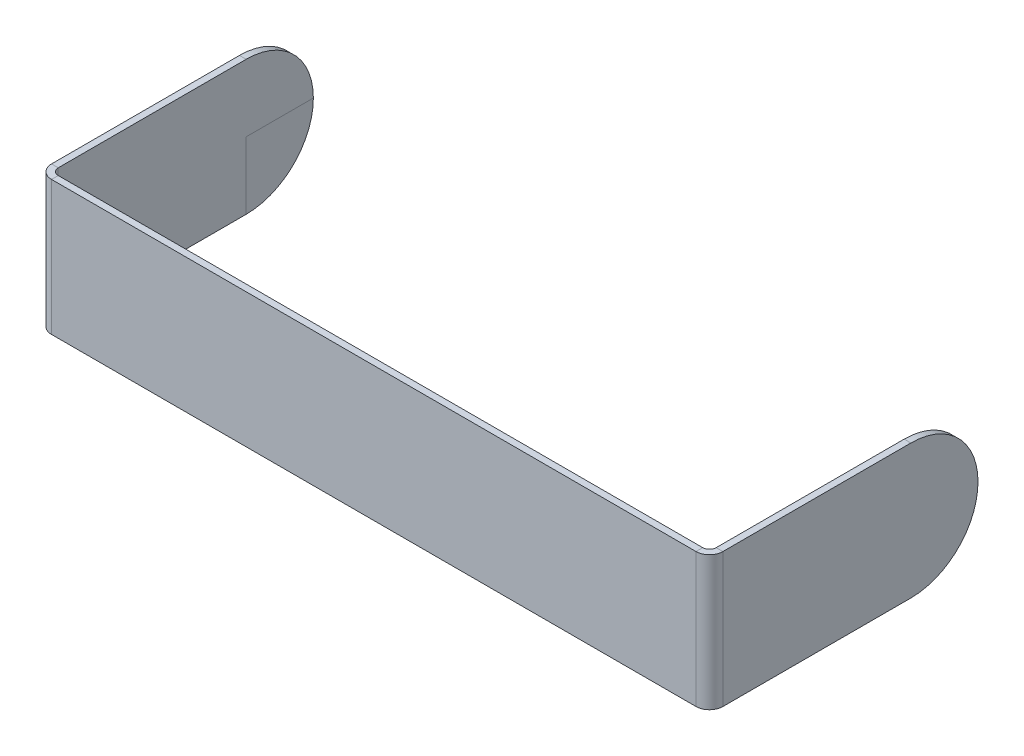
ISO-10303-21;
HEADER;
FILE_DESCRIPTION(('STEP AP214'),'2;1');
FILE_NAME('part.step','',(''),(''),'','','');
FILE_SCHEMA(('AUTOMOTIVE_DESIGN { 1 0 10303 214 1 1 1 1 }'));
ENDSEC;
DATA;
#1=APPLICATION_CONTEXT('core data for automotive mechanical design processes');
#2=APPLICATION_PROTOCOL_DEFINITION('international standard','automotive_design',2000,#1);
#3=PRODUCT_CONTEXT('',#1,'mechanical');
#4=PRODUCT('Part','Part','',(#3));
#5=PRODUCT_RELATED_PRODUCT_CATEGORY('part','',(#4));
#6=PRODUCT_DEFINITION_FORMATION('','',#4);
#7=PRODUCT_DEFINITION_CONTEXT('part definition',#1,'design');
#8=PRODUCT_DEFINITION('design','',#6,#7);
#9=PRODUCT_DEFINITION_SHAPE('','',#8);
#10=(LENGTH_UNIT() NAMED_UNIT(*) SI_UNIT(.MILLI.,.METRE.));
#11=(NAMED_UNIT(*) PLANE_ANGLE_UNIT() SI_UNIT($,.RADIAN.));
#12=(NAMED_UNIT(*) SI_UNIT($,.STERADIAN.) SOLID_ANGLE_UNIT());
#13=UNCERTAINTY_MEASURE_WITH_UNIT(LENGTH_MEASURE(1.E-05),#10,'distance_accuracy_value','');
#14=(GEOMETRIC_REPRESENTATION_CONTEXT(3) GLOBAL_UNCERTAINTY_ASSIGNED_CONTEXT((#13)) GLOBAL_UNIT_ASSIGNED_CONTEXT((#10,
#11,#12)) REPRESENTATION_CONTEXT('',''));
#15=CARTESIAN_POINT('',(0.,0.,0.));
#16=DIRECTION('',(0.,0.,1.));
#17=DIRECTION('',(1.,0.,0.));
#18=AXIS2_PLACEMENT_3D('',#15,#16,#17);
#19=CARTESIAN_POINT('',(-490.,100.,0.));
#20=DIRECTION('',(-1.,0.,0.));
#21=DIRECTION('',(0.,0.,1.));
#22=AXIS2_PLACEMENT_3D('',#19,#20,#21);
#23=PLANE('',#22);
#24=DIRECTION('',(0.,0.,1.));
#25=VECTOR('',#24,1.);
#26=CARTESIAN_POINT('',(-490.,0.,0.));
#27=LINE('',#26,#25);
#28=CARTESIAN_POINT('',(-490.,0.,-400.));
#29=VERTEX_POINT('',#28);
#30=CARTESIAN_POINT('',(-490.,0.,-300.));
#31=VERTEX_POINT('',#30);
#32=EDGE_CURVE('E11',#29,#31,#27,.T.);
#33=ORIENTED_EDGE('',*,*,#32,.F.);
#34=CARTESIAN_POINT('',(-490.,0.,-300.));
#35=DIRECTION('',(-1.,0.,0.));
#36=DIRECTION('',(0.,0.,1.));
#37=AXIS2_PLACEMENT_3D('',#34,#35,#36);
#38=CIRCLE('',#37,100.);
#39=CARTESIAN_POINT('',(-490.,100.,-300.));
#40=VERTEX_POINT('',#39);
#41=EDGE_CURVE('E148',#40,#29,#38,.T.);
#42=ORIENTED_EDGE('',*,*,#41,.F.);
#43=DIRECTION('',(0.,0.,-1.));
#44=VECTOR('',#43,1.);
#45=CARTESIAN_POINT('',(-490.,100.,0.));
#46=LINE('',#45,#44);
#47=CARTESIAN_POINT('',(-490.,100.,-20.));
#48=VERTEX_POINT('',#47);
#49=EDGE_CURVE('E157',#48,#40,#46,.T.);
#50=ORIENTED_EDGE('',*,*,#49,.F.);
#51=DIRECTION('',(0.,-1.,0.));
#52=VECTOR('',#51,1.);
#53=CARTESIAN_POINT('',(-490.,100.,-20.));
#54=LINE('',#53,#52);
#55=CARTESIAN_POINT('',(-490.,-100.,-20.));
#56=VERTEX_POINT('',#55);
#57=EDGE_CURVE('E192',#48,#56,#54,.T.);
#58=ORIENTED_EDGE('',*,*,#57,.T.);
#59=DIRECTION('',(0.,0.,-1.));
#60=VECTOR('',#59,1.);
#61=CARTESIAN_POINT('',(-490.,-100.,0.));
#62=LINE('',#61,#60);
#63=CARTESIAN_POINT('',(-490.,-100.,-300.));
#64=VERTEX_POINT('',#63);
#65=EDGE_CURVE('E193',#56,#64,#62,.T.);
#66=ORIENTED_EDGE('',*,*,#65,.T.);
#67=DIRECTION('',(0.,-1.,0.));
#68=VECTOR('',#67,1.);
#69=CARTESIAN_POINT('',(-490.,100.,-300.));
#70=LINE('',#69,#68);
#71=EDGE_CURVE('E42',#31,#64,#70,.T.);
#72=ORIENTED_EDGE('',*,*,#71,.F.);
#73=EDGE_LOOP('',(#33,#42,#50,#58,#66,#72));
#74=FACE_BOUND('',#73,.T.);
#75=ADVANCED_FACE('F38',(#74),#23,.F.);
#76=CARTESIAN_POINT('',(490.,100.,0.));
#77=DIRECTION('',(1.,0.,0.));
#78=DIRECTION('',(0.,0.,-1.));
#79=AXIS2_PLACEMENT_3D('',#76,#77,#78);
#80=PLANE('',#79);
#81=DIRECTION('',(0.,0.,-1.));
#82=VECTOR('',#81,1.);
#83=CARTESIAN_POINT('',(490.,0.,0.));
#84=LINE('',#83,#82);
#85=CARTESIAN_POINT('',(490.,0.,-300.));
#86=VERTEX_POINT('',#85);
#87=CARTESIAN_POINT('',(490.,0.,-400.));
#88=VERTEX_POINT('',#87);
#89=EDGE_CURVE('E268',#86,#88,#84,.T.);
#90=ORIENTED_EDGE('',*,*,#89,.F.);
#91=DIRECTION('',(0.,1.,0.));
#92=VECTOR('',#91,1.);
#93=CARTESIAN_POINT('',(490.,100.,-300.));
#94=LINE('',#93,#92);
#95=CARTESIAN_POINT('',(490.,-100.,-300.));
#96=VERTEX_POINT('',#95);
#97=EDGE_CURVE('E264',#96,#86,#94,.T.);
#98=ORIENTED_EDGE('',*,*,#97,.F.);
#99=DIRECTION('',(0.,0.,1.));
#100=VECTOR('',#99,1.);
#101=CARTESIAN_POINT('',(490.,-100.,0.));
#102=LINE('',#101,#100);
#103=CARTESIAN_POINT('',(490.,-100.,-20.));
#104=VERTEX_POINT('',#103);
#105=EDGE_CURVE('E215',#96,#104,#102,.T.);
#106=ORIENTED_EDGE('',*,*,#105,.T.);
#107=DIRECTION('',(0.,-1.,0.));
#108=VECTOR('',#107,1.);
#109=CARTESIAN_POINT('',(490.,100.,-20.));
#110=LINE('',#109,#108);
#111=CARTESIAN_POINT('',(490.,100.,-20.));
#112=VERTEX_POINT('',#111);
#113=EDGE_CURVE('E235',#112,#104,#110,.T.);
#114=ORIENTED_EDGE('',*,*,#113,.F.);
#115=DIRECTION('',(0.,0.,1.));
#116=VECTOR('',#115,1.);
#117=CARTESIAN_POINT('',(490.,100.,0.));
#118=LINE('',#117,#116);
#119=CARTESIAN_POINT('',(490.,100.,-300.));
#120=VERTEX_POINT('',#119);
#121=EDGE_CURVE('E180',#120,#112,#118,.T.);
#122=ORIENTED_EDGE('',*,*,#121,.F.);
#123=CARTESIAN_POINT('',(490.,0.,-300.));
#124=DIRECTION('',(-1.,0.,0.));
#125=DIRECTION('',(0.,0.,1.));
#126=AXIS2_PLACEMENT_3D('',#123,#124,#125);
#127=CIRCLE('',#126,100.);
#128=EDGE_CURVE('E324',#120,#88,#127,.T.);
#129=ORIENTED_EDGE('',*,*,#128,.T.);
#130=EDGE_LOOP('',(#90,#98,#106,#114,#122,#129));
#131=FACE_BOUND('',#130,.T.);
#132=ADVANCED_FACE('F330',(#131),#80,.F.);
#133=CARTESIAN_POINT('',(480.,100.,0.));
#134=DIRECTION('',(0.,1.,0.));
#135=DIRECTION('',(0.,0.,1.));
#136=AXIS2_PLACEMENT_3D('',#133,#134,#135);
#137=PLANE('',#136);
#138=DIRECTION('',(0.,0.,-1.));
#139=VECTOR('',#138,1.);
#140=CARTESIAN_POINT('',(480.,100.,0.));
#141=LINE('',#140,#139);
#142=CARTESIAN_POINT('',(480.,100.,0.));
#143=VERTEX_POINT('',#142);
#144=CARTESIAN_POINT('',(480.,100.,-10.));
#145=VERTEX_POINT('',#144);
#146=EDGE_CURVE('E262',#143,#145,#141,.T.);
#147=ORIENTED_EDGE('',*,*,#146,.F.);
#148=CARTESIAN_POINT('',(480.,100.,-20.));
#149=DIRECTION('',(0.,1.,0.));
#150=DIRECTION('',(0.,0.,1.));
#151=AXIS2_PLACEMENT_3D('',#148,#149,#150);
#152=CIRCLE('',#151,20.);
#153=CARTESIAN_POINT('',(500.,100.,-20.));
#154=VERTEX_POINT('',#153);
#155=EDGE_CURVE('E171',#154,#143,#152,.F.);
#156=ORIENTED_EDGE('',*,*,#155,.F.);
#157=DIRECTION('',(1.,0.,0.));
#158=VECTOR('',#157,1.);
#159=CARTESIAN_POINT('',(490.,100.,-20.));
#160=LINE('',#159,#158);
#161=EDGE_CURVE('E260',#112,#154,#160,.T.);
#162=ORIENTED_EDGE('',*,*,#161,.F.);
#163=CARTESIAN_POINT('',(480.,100.,-20.));
#164=DIRECTION('',(0.,1.,0.));
#165=DIRECTION('',(1.,0.,0.));
#166=AXIS2_PLACEMENT_3D('',#163,#164,#165);
#167=CIRCLE('',#166,10.);
#168=EDGE_CURVE('E183',#112,#145,#167,.F.);
#169=ORIENTED_EDGE('',*,*,#168,.T.);
#170=EDGE_LOOP('',(#147,#156,#162,#169));
#171=FACE_BOUND('',#170,.T.);
#172=ADVANCED_FACE('F40',(#171),#137,.T.);
#173=CARTESIAN_POINT('',(490.,100.,-20.));
#174=DIRECTION('',(0.,1.,0.));
#175=DIRECTION('',(0.,0.,1.));
#176=AXIS2_PLACEMENT_3D('',#173,#174,#175);
#177=PLANE('',#176);
#178=DIRECTION('',(-1.,0.,0.));
#179=VECTOR('',#178,1.);
#180=CARTESIAN_POINT('',(-500.,100.,0.));
#181=LINE('',#180,#179);
#182=CARTESIAN_POINT('',(-480.,100.,0.));
#183=VERTEX_POINT('',#182);
#184=EDGE_CURVE('E165',#143,#183,#181,.T.);
#185=ORIENTED_EDGE('',*,*,#184,.F.);
#186=ORIENTED_EDGE('',*,*,#146,.T.);
#187=DIRECTION('',(1.,0.,0.));
#188=VECTOR('',#187,1.);
#189=CARTESIAN_POINT('',(-500.,100.,-10.));
#190=LINE('',#189,#188);
#191=CARTESIAN_POINT('',(-480.,100.,-10.));
#192=VERTEX_POINT('',#191);
#193=EDGE_CURVE('E186',#145,#192,#190,.F.);
#194=ORIENTED_EDGE('',*,*,#193,.T.);
#195=DIRECTION('',(0.,0.,1.));
#196=VECTOR('',#195,1.);
#197=CARTESIAN_POINT('',(-480.,100.,-10.));
#198=LINE('',#197,#196);
#199=EDGE_CURVE('E252',#192,#183,#198,.T.);
#200=ORIENTED_EDGE('',*,*,#199,.T.);
#201=EDGE_LOOP('',(#185,#186,#194,#200));
#202=FACE_BOUND('',#201,.T.);
#203=ADVANCED_FACE('F338',(#202),#177,.T.);
#204=CARTESIAN_POINT('',(500.,-100.,-20.));
#205=DIRECTION('',(0.,-1.,0.));
#206=DIRECTION('',(0.,0.,-1.));
#207=AXIS2_PLACEMENT_3D('',#204,#205,#206);
#208=PLANE('',#207);
#209=DIRECTION('',(-1.,0.,0.));
#210=VECTOR('',#209,1.);
#211=CARTESIAN_POINT('',(500.,-100.,-20.));
#212=LINE('',#211,#210);
#213=CARTESIAN_POINT('',(500.,-100.,-20.));
#214=VERTEX_POINT('',#213);
#215=EDGE_CURVE('E258',#214,#104,#212,.T.);
#216=ORIENTED_EDGE('',*,*,#215,.F.);
#217=CARTESIAN_POINT('',(480.,-100.,-20.));
#218=DIRECTION('',(0.,1.,0.));
#219=DIRECTION('',(0.,0.,1.));
#220=AXIS2_PLACEMENT_3D('',#217,#218,#219);
#221=CIRCLE('',#220,20.);
#222=CARTESIAN_POINT('',(480.,-100.,0.));
#223=VERTEX_POINT('',#222);
#224=EDGE_CURVE('E206',#214,#223,#221,.F.);
#225=ORIENTED_EDGE('',*,*,#224,.T.);
#226=DIRECTION('',(0.,0.,1.));
#227=VECTOR('',#226,1.);
#228=CARTESIAN_POINT('',(480.,-100.,-10.));
#229=LINE('',#228,#227);
#230=CARTESIAN_POINT('',(480.,-100.,-10.));
#231=VERTEX_POINT('',#230);
#232=EDGE_CURVE('E256',#231,#223,#229,.T.);
#233=ORIENTED_EDGE('',*,*,#232,.F.);
#234=CARTESIAN_POINT('',(480.,-100.,-20.));
#235=DIRECTION('',(0.,1.,0.));
#236=DIRECTION('',(1.,0.,0.));
#237=AXIS2_PLACEMENT_3D('',#234,#235,#236);
#238=CIRCLE('',#237,10.);
#239=EDGE_CURVE('E218',#104,#231,#238,.F.);
#240=ORIENTED_EDGE('',*,*,#239,.F.);
#241=EDGE_LOOP('',(#216,#225,#233,#240));
#242=FACE_BOUND('',#241,.T.);
#243=ADVANCED_FACE('F303',(#242),#208,.T.);
#244=CARTESIAN_POINT('',(480.,-100.,-10.));
#245=DIRECTION('',(0.,-1.,0.));
#246=DIRECTION('',(0.,0.,-1.));
#247=AXIS2_PLACEMENT_3D('',#244,#245,#246);
#248=PLANE('',#247);
#249=DIRECTION('',(0.,0.,1.));
#250=VECTOR('',#249,1.);
#251=CARTESIAN_POINT('',(500.,-100.,0.));
#252=LINE('',#251,#250);
#253=CARTESIAN_POINT('',(500.,-100.,-300.));
#254=VERTEX_POINT('',#253);
#255=EDGE_CURVE('E209',#254,#214,#252,.T.);
#256=ORIENTED_EDGE('',*,*,#255,.T.);
#257=ORIENTED_EDGE('',*,*,#215,.T.);
#258=ORIENTED_EDGE('',*,*,#105,.F.);
#259=DIRECTION('',(1.,0.,0.));
#260=VECTOR('',#259,1.);
#261=CARTESIAN_POINT('',(490.,-100.,-300.));
#262=LINE('',#261,#260);
#263=EDGE_CURVE('E212',#96,#254,#262,.T.);
#264=ORIENTED_EDGE('',*,*,#263,.T.);
#265=EDGE_LOOP('',(#256,#257,#258,#264));
#266=FACE_BOUND('',#265,.T.);
#267=ADVANCED_FACE('F310',(#266),#248,.T.);
#268=CARTESIAN_POINT('',(-500.,100.,-20.));
#269=DIRECTION('',(0.,1.,0.));
#270=DIRECTION('',(0.,0.,1.));
#271=AXIS2_PLACEMENT_3D('',#268,#269,#270);
#272=PLANE('',#271);
#273=DIRECTION('',(1.,0.,0.));
#274=VECTOR('',#273,1.);
#275=CARTESIAN_POINT('',(-500.,100.,-20.));
#276=LINE('',#275,#274);
#277=CARTESIAN_POINT('',(-500.,100.,-20.));
#278=VERTEX_POINT('',#277);
#279=EDGE_CURVE('E254',#278,#48,#276,.T.);
#280=ORIENTED_EDGE('',*,*,#279,.F.);
#281=CARTESIAN_POINT('',(-480.,100.,-20.));
#282=DIRECTION('',(0.,1.,0.));
#283=DIRECTION('',(0.,0.,1.));
#284=AXIS2_PLACEMENT_3D('',#281,#282,#283);
#285=CIRCLE('',#284,20.);
#286=EDGE_CURVE('E163',#183,#278,#285,.F.);
#287=ORIENTED_EDGE('',*,*,#286,.F.);
#288=ORIENTED_EDGE('',*,*,#199,.F.);
#289=CARTESIAN_POINT('',(-480.,100.,-20.));
#290=DIRECTION('',(0.,1.,0.));
#291=DIRECTION('',(1.,0.,0.));
#292=AXIS2_PLACEMENT_3D('',#289,#290,#291);
#293=CIRCLE('',#292,10.);
#294=EDGE_CURVE('E189',#192,#48,#293,.F.);
#295=ORIENTED_EDGE('',*,*,#294,.T.);
#296=EDGE_LOOP('',(#280,#287,#288,#295));
#297=FACE_BOUND('',#296,.T.);
#298=ADVANCED_FACE('F341',(#297),#272,.T.);
#299=CARTESIAN_POINT('',(-480.,100.,-10.));
#300=DIRECTION('',(0.,1.,0.));
#301=DIRECTION('',(0.,0.,1.));
#302=AXIS2_PLACEMENT_3D('',#299,#300,#301);
#303=PLANE('',#302);
#304=DIRECTION('',(0.,0.,-1.));
#305=VECTOR('',#304,1.);
#306=CARTESIAN_POINT('',(-500.,100.,0.));
#307=LINE('',#306,#305);
#308=CARTESIAN_POINT('',(-500.,100.,-300.));
#309=VERTEX_POINT('',#308);
#310=EDGE_CURVE('E154',#278,#309,#307,.T.);
#311=ORIENTED_EDGE('',*,*,#310,.F.);
#312=ORIENTED_EDGE('',*,*,#279,.T.);
#313=ORIENTED_EDGE('',*,*,#49,.T.);
#314=DIRECTION('',(1.,0.,0.));
#315=VECTOR('',#314,1.);
#316=CARTESIAN_POINT('',(-500.,100.,-300.));
#317=LINE('',#316,#315);
#318=EDGE_CURVE('E139',#309,#40,#317,.T.);
#319=ORIENTED_EDGE('',*,*,#318,.F.);
#320=EDGE_LOOP('',(#311,#312,#313,#319));
#321=FACE_BOUND('',#320,.T.);
#322=ADVANCED_FACE('F153',(#321),#303,.T.);
#323=CARTESIAN_POINT('',(-480.,-100.,0.));
#324=DIRECTION('',(0.,-1.,0.));
#325=DIRECTION('',(0.,0.,-1.));
#326=AXIS2_PLACEMENT_3D('',#323,#324,#325);
#327=PLANE('',#326);
#328=DIRECTION('',(0.,0.,-1.));
#329=VECTOR('',#328,1.);
#330=CARTESIAN_POINT('',(-480.,-100.,0.));
#331=LINE('',#330,#329);
#332=CARTESIAN_POINT('',(-480.,-100.,0.));
#333=VERTEX_POINT('',#332);
#334=CARTESIAN_POINT('',(-480.,-100.,-10.));
#335=VERTEX_POINT('',#334);
#336=EDGE_CURVE('E250',#333,#335,#331,.T.);
#337=ORIENTED_EDGE('',*,*,#336,.F.);
#338=CARTESIAN_POINT('',(-480.,-100.,-20.));
#339=DIRECTION('',(0.,1.,0.));
#340=DIRECTION('',(0.,0.,1.));
#341=AXIS2_PLACEMENT_3D('',#338,#339,#340);
#342=CIRCLE('',#341,20.);
#343=CARTESIAN_POINT('',(-500.,-100.,-20.));
#344=VERTEX_POINT('',#343);
#345=EDGE_CURVE('E200',#333,#344,#342,.F.);
#346=ORIENTED_EDGE('',*,*,#345,.T.);
#347=DIRECTION('',(-1.,0.,0.));
#348=VECTOR('',#347,1.);
#349=CARTESIAN_POINT('',(-490.,-100.,-20.));
#350=LINE('',#349,#348);
#351=EDGE_CURVE('E248',#56,#344,#350,.T.);
#352=ORIENTED_EDGE('',*,*,#351,.F.);
#353=CARTESIAN_POINT('',(-480.,-100.,-20.));
#354=DIRECTION('',(0.,1.,0.));
#355=DIRECTION('',(1.,0.,0.));
#356=AXIS2_PLACEMENT_3D('',#353,#354,#355);
#357=CIRCLE('',#356,10.);
#358=EDGE_CURVE('E224',#335,#56,#357,.F.);
#359=ORIENTED_EDGE('',*,*,#358,.F.);
#360=EDGE_LOOP('',(#337,#346,#352,#359));
#361=FACE_BOUND('',#360,.T.);
#362=ADVANCED_FACE('F287',(#361),#327,.T.);
#363=CARTESIAN_POINT('',(-490.,-100.,-20.));
#364=DIRECTION('',(0.,-1.,0.));
#365=DIRECTION('',(0.,0.,-1.));
#366=AXIS2_PLACEMENT_3D('',#363,#364,#365);
#367=PLANE('',#366);
#368=DIRECTION('',(-1.,0.,0.));
#369=VECTOR('',#368,1.);
#370=CARTESIAN_POINT('',(-500.,-100.,0.));
#371=LINE('',#370,#369);
#372=EDGE_CURVE('E203',#223,#333,#371,.T.);
#373=ORIENTED_EDGE('',*,*,#372,.T.);
#374=ORIENTED_EDGE('',*,*,#336,.T.);
#375=DIRECTION('',(1.,0.,0.));
#376=VECTOR('',#375,1.);
#377=CARTESIAN_POINT('',(-500.,-100.,-10.));
#378=LINE('',#377,#376);
#379=EDGE_CURVE('E221',#231,#335,#378,.F.);
#380=ORIENTED_EDGE('',*,*,#379,.F.);
#381=ORIENTED_EDGE('',*,*,#232,.T.);
#382=EDGE_LOOP('',(#373,#374,#380,#381));
#383=FACE_BOUND('',#382,.T.);
#384=ADVANCED_FACE('F295',(#383),#367,.T.);
#385=EDGE_CURVE('E279',#29,#64,#38,.T.);
#386=ORIENTED_EDGE('',*,*,#385,.F.);
#387=ORIENTED_EDGE('',*,*,#32,.T.);
#388=ORIENTED_EDGE('',*,*,#71,.T.);
#389=EDGE_LOOP('',(#386,#387,#388));
#390=FACE_BOUND('',#389,.T.);
#391=ADVANCED_FACE('F278',(#390),#23,.F.);
#392=CARTESIAN_POINT('',(-500.,100.,0.));
#393=DIRECTION('',(-1.,0.,0.));
#394=DIRECTION('',(0.,0.,1.));
#395=AXIS2_PLACEMENT_3D('',#392,#393,#394);
#396=PLANE('',#395);
#397=DIRECTION('',(0.,0.,-1.));
#398=VECTOR('',#397,1.);
#399=CARTESIAN_POINT('',(-500.,-100.,0.));
#400=LINE('',#399,#398);
#401=CARTESIAN_POINT('',(-500.,-100.,-300.));
#402=VERTEX_POINT('',#401);
#403=EDGE_CURVE('E198',#344,#402,#400,.T.);
#404=ORIENTED_EDGE('',*,*,#403,.F.);
#405=DIRECTION('',(0.,-1.,0.));
#406=VECTOR('',#405,1.);
#407=CARTESIAN_POINT('',(-500.,100.,-20.));
#408=LINE('',#407,#406);
#409=EDGE_CURVE('E162',#278,#344,#408,.T.);
#410=ORIENTED_EDGE('',*,*,#409,.F.);
#411=ORIENTED_EDGE('',*,*,#310,.T.);
#412=CARTESIAN_POINT('',(-500.,0.,-300.));
#413=DIRECTION('',(-1.,0.,0.));
#414=DIRECTION('',(0.,0.,1.));
#415=AXIS2_PLACEMENT_3D('',#412,#413,#414);
#416=CIRCLE('',#415,100.);
#417=EDGE_CURVE('E135',#309,#402,#416,.T.);
#418=ORIENTED_EDGE('',*,*,#417,.T.);
#419=EDGE_LOOP('',(#404,#410,#411,#418));
#420=FACE_BOUND('',#419,.T.);
#421=ADVANCED_FACE('F160',(#420),#396,.T.);
#422=CARTESIAN_POINT('',(-480.,100.,-20.));
#423=DIRECTION('',(0.,-1.,0.));
#424=DIRECTION('',(0.,0.,-1.));
#425=AXIS2_PLACEMENT_3D('',#422,#423,#424);
#426=CYLINDRICAL_SURFACE('',#425,20.);
#427=ORIENTED_EDGE('',*,*,#345,.F.);
#428=DIRECTION('',(0.,-1.,0.));
#429=VECTOR('',#428,1.);
#430=CARTESIAN_POINT('',(-480.,100.,0.));
#431=LINE('',#430,#429);
#432=EDGE_CURVE('E244',#183,#333,#431,.T.);
#433=ORIENTED_EDGE('',*,*,#432,.F.);
#434=ORIENTED_EDGE('',*,*,#286,.T.);
#435=ORIENTED_EDGE('',*,*,#409,.T.);
#436=EDGE_LOOP('',(#427,#433,#434,#435));
#437=FACE_BOUND('',#436,.T.);
#438=ADVANCED_FACE('F291',(#437),#426,.T.);
#439=CARTESIAN_POINT('',(-500.,100.,0.));
#440=DIRECTION('',(0.,0.,1.));
#441=DIRECTION('',(1.,0.,0.));
#442=AXIS2_PLACEMENT_3D('',#439,#440,#441);
#443=PLANE('',#442);
#444=ORIENTED_EDGE('',*,*,#372,.F.);
#445=DIRECTION('',(0.,-1.,0.));
#446=VECTOR('',#445,1.);
#447=CARTESIAN_POINT('',(480.,100.,0.));
#448=LINE('',#447,#446);
#449=EDGE_CURVE('E241',#143,#223,#448,.T.);
#450=ORIENTED_EDGE('',*,*,#449,.F.);
#451=ORIENTED_EDGE('',*,*,#184,.T.);
#452=ORIENTED_EDGE('',*,*,#432,.T.);
#453=EDGE_LOOP('',(#444,#450,#451,#452));
#454=FACE_BOUND('',#453,.T.);
#455=ADVANCED_FACE('F299',(#454),#443,.T.);
#456=CARTESIAN_POINT('',(480.,100.,-20.));
#457=DIRECTION('',(0.,-1.,0.));
#458=DIRECTION('',(0.,0.,-1.));
#459=AXIS2_PLACEMENT_3D('',#456,#457,#458);
#460=CYLINDRICAL_SURFACE('',#459,20.);
#461=ORIENTED_EDGE('',*,*,#224,.F.);
#462=DIRECTION('',(0.,-1.,0.));
#463=VECTOR('',#462,1.);
#464=CARTESIAN_POINT('',(500.,100.,-20.));
#465=LINE('',#464,#463);
#466=EDGE_CURVE('E238',#154,#214,#465,.T.);
#467=ORIENTED_EDGE('',*,*,#466,.F.);
#468=ORIENTED_EDGE('',*,*,#155,.T.);
#469=ORIENTED_EDGE('',*,*,#449,.T.);
#470=EDGE_LOOP('',(#461,#467,#468,#469));
#471=FACE_BOUND('',#470,.T.);
#472=ADVANCED_FACE('F307',(#471),#460,.T.);
#473=CARTESIAN_POINT('',(500.,100.,0.));
#474=DIRECTION('',(1.,0.,0.));
#475=DIRECTION('',(0.,0.,-1.));
#476=AXIS2_PLACEMENT_3D('',#473,#474,#475);
#477=PLANE('',#476);
#478=ORIENTED_EDGE('',*,*,#255,.F.);
#479=CARTESIAN_POINT('',(500.,0.,-300.));
#480=DIRECTION('',(-1.,0.,0.));
#481=DIRECTION('',(0.,0.,1.));
#482=AXIS2_PLACEMENT_3D('',#479,#480,#481);
#483=CIRCLE('',#482,100.);
#484=CARTESIAN_POINT('',(500.,100.,-300.));
#485=VERTEX_POINT('',#484);
#486=EDGE_CURVE('E196',#485,#254,#483,.T.);
#487=ORIENTED_EDGE('',*,*,#486,.F.);
#488=DIRECTION('',(0.,0.,1.));
#489=VECTOR('',#488,1.);
#490=CARTESIAN_POINT('',(500.,100.,0.));
#491=LINE('',#490,#489);
#492=EDGE_CURVE('E174',#485,#154,#491,.T.);
#493=ORIENTED_EDGE('',*,*,#492,.T.);
#494=ORIENTED_EDGE('',*,*,#466,.T.);
#495=EDGE_LOOP('',(#478,#487,#493,#494));
#496=FACE_BOUND('',#495,.T.);
#497=ADVANCED_FACE('F316',(#496),#477,.T.);
#498=ORIENTED_EDGE('',*,*,#97,.T.);
#499=ORIENTED_EDGE('',*,*,#89,.T.);
#500=EDGE_CURVE('E147',#88,#96,#127,.T.);
#501=ORIENTED_EDGE('',*,*,#500,.T.);
#502=EDGE_LOOP('',(#498,#499,#501));
#503=FACE_BOUND('',#502,.T.);
#504=ADVANCED_FACE('F328',(#503),#80,.F.);
#505=CARTESIAN_POINT('',(480.,100.,-20.));
#506=DIRECTION('',(0.,-1.,0.));
#507=DIRECTION('',(0.,0.,-1.));
#508=AXIS2_PLACEMENT_3D('',#505,#506,#507);
#509=CYLINDRICAL_SURFACE('',#508,10.);
#510=ORIENTED_EDGE('',*,*,#239,.T.);
#511=DIRECTION('',(0.,-1.,0.));
#512=VECTOR('',#511,1.);
#513=CARTESIAN_POINT('',(480.,100.,-10.));
#514=LINE('',#513,#512);
#515=EDGE_CURVE('E232',#145,#231,#514,.T.);
#516=ORIENTED_EDGE('',*,*,#515,.F.);
#517=ORIENTED_EDGE('',*,*,#168,.F.);
#518=ORIENTED_EDGE('',*,*,#113,.T.);
#519=EDGE_LOOP('',(#510,#516,#517,#518));
#520=FACE_BOUND('',#519,.T.);
#521=ADVANCED_FACE('F333',(#520),#509,.F.);
#522=CARTESIAN_POINT('',(-500.,100.,-10.));
#523=DIRECTION('',(0.,0.,1.));
#524=DIRECTION('',(1.,0.,0.));
#525=AXIS2_PLACEMENT_3D('',#522,#523,#524);
#526=PLANE('',#525);
#527=ORIENTED_EDGE('',*,*,#379,.T.);
#528=DIRECTION('',(0.,-1.,0.));
#529=VECTOR('',#528,1.);
#530=CARTESIAN_POINT('',(-480.,100.,-10.));
#531=LINE('',#530,#529);
#532=EDGE_CURVE('E229',#192,#335,#531,.T.);
#533=ORIENTED_EDGE('',*,*,#532,.F.);
#534=ORIENTED_EDGE('',*,*,#193,.F.);
#535=ORIENTED_EDGE('',*,*,#515,.T.);
#536=EDGE_LOOP('',(#527,#533,#534,#535));
#537=FACE_BOUND('',#536,.T.);
#538=ADVANCED_FACE('F346',(#537),#526,.F.);
#539=CARTESIAN_POINT('',(-480.,100.,-20.));
#540=DIRECTION('',(0.,-1.,0.));
#541=DIRECTION('',(0.,0.,-1.));
#542=AXIS2_PLACEMENT_3D('',#539,#540,#541);
#543=CYLINDRICAL_SURFACE('',#542,10.);
#544=ORIENTED_EDGE('',*,*,#358,.T.);
#545=ORIENTED_EDGE('',*,*,#57,.F.);
#546=ORIENTED_EDGE('',*,*,#294,.F.);
#547=ORIENTED_EDGE('',*,*,#532,.T.);
#548=EDGE_LOOP('',(#544,#545,#546,#547));
#549=FACE_BOUND('',#548,.T.);
#550=ADVANCED_FACE('F344',(#549),#543,.F.);
#551=CARTESIAN_POINT('',(-480.,100.,-20.));
#552=DIRECTION('',(0.,1.,0.));
#553=DIRECTION('',(0.,0.,1.));
#554=AXIS2_PLACEMENT_3D('',#551,#552,#553);
#555=PLANE('',#554);
#556=ORIENTED_EDGE('',*,*,#121,.T.);
#557=ORIENTED_EDGE('',*,*,#161,.T.);
#558=ORIENTED_EDGE('',*,*,#492,.F.);
#559=DIRECTION('',(1.,0.,0.));
#560=VECTOR('',#559,1.);
#561=CARTESIAN_POINT('',(490.,100.,-300.));
#562=LINE('',#561,#560);
#563=EDGE_CURVE('E177',#120,#485,#562,.T.);
#564=ORIENTED_EDGE('',*,*,#563,.F.);
#565=EDGE_LOOP('',(#556,#557,#558,#564));
#566=FACE_BOUND('',#565,.T.);
#567=ADVANCED_FACE('F319',(#566),#555,.T.);
#568=CARTESIAN_POINT('',(-480.,-100.,-20.));
#569=DIRECTION('',(0.,1.,0.));
#570=DIRECTION('',(0.,0.,1.));
#571=AXIS2_PLACEMENT_3D('',#568,#569,#570);
#572=PLANE('',#571);
#573=ORIENTED_EDGE('',*,*,#65,.F.);
#574=ORIENTED_EDGE('',*,*,#351,.T.);
#575=ORIENTED_EDGE('',*,*,#403,.T.);
#576=DIRECTION('',(1.,0.,0.));
#577=VECTOR('',#576,1.);
#578=CARTESIAN_POINT('',(-500.,-100.,-300.));
#579=LINE('',#578,#577);
#580=EDGE_CURVE('E142',#402,#64,#579,.T.);
#581=ORIENTED_EDGE('',*,*,#580,.T.);
#582=EDGE_LOOP('',(#573,#574,#575,#581));
#583=FACE_BOUND('',#582,.T.);
#584=ADVANCED_FACE('F284',(#583),#572,.F.);
#585=CARTESIAN_POINT('',(500.,0.,-300.));
#586=DIRECTION('',(-1.,0.,0.));
#587=DIRECTION('',(0.,0.,1.));
#588=AXIS2_PLACEMENT_3D('',#585,#586,#587);
#589=CYLINDRICAL_SURFACE('',#588,100.);
#590=ORIENTED_EDGE('',*,*,#128,.F.);
#591=ORIENTED_EDGE('',*,*,#563,.T.);
#592=ORIENTED_EDGE('',*,*,#486,.T.);
#593=ORIENTED_EDGE('',*,*,#263,.F.);
#594=ORIENTED_EDGE('',*,*,#500,.F.);
#595=EDGE_LOOP('',(#590,#591,#592,#593,#594));
#596=FACE_BOUND('',#595,.T.);
#597=ADVANCED_FACE('F322',(#596),#589,.T.);
#598=CARTESIAN_POINT('',(-500.,0.,-300.));
#599=DIRECTION('',(1.,0.,0.));
#600=DIRECTION('',(0.,0.,-1.));
#601=AXIS2_PLACEMENT_3D('',#598,#599,#600);
#602=CYLINDRICAL_SURFACE('',#601,100.);
#603=ORIENTED_EDGE('',*,*,#41,.T.);
#604=ORIENTED_EDGE('',*,*,#385,.T.);
#605=ORIENTED_EDGE('',*,*,#580,.F.);
#606=ORIENTED_EDGE('',*,*,#417,.F.);
#607=ORIENTED_EDGE('',*,*,#318,.T.);
#608=EDGE_LOOP('',(#603,#604,#605,#606,#607));
#609=FACE_BOUND('',#608,.T.);
#610=ADVANCED_FACE('F138',(#609),#602,.T.);
#611=CLOSED_SHELL('',(#75,#132,#172,#203,#243,#267,#298,#322,#362,#384,#391,#421,#438,#455,#472,
#497,#504,#521,#538,#550,#567,#584,#597,#610));
#612=MANIFOLD_SOLID_BREP('B2',#611);
#613=ADVANCED_BREP_SHAPE_REPRESENTATION('',(#18,#612),#14);
#614=SHAPE_DEFINITION_REPRESENTATION(#9,#613);
ENDSEC;
END-ISO-10303-21;
